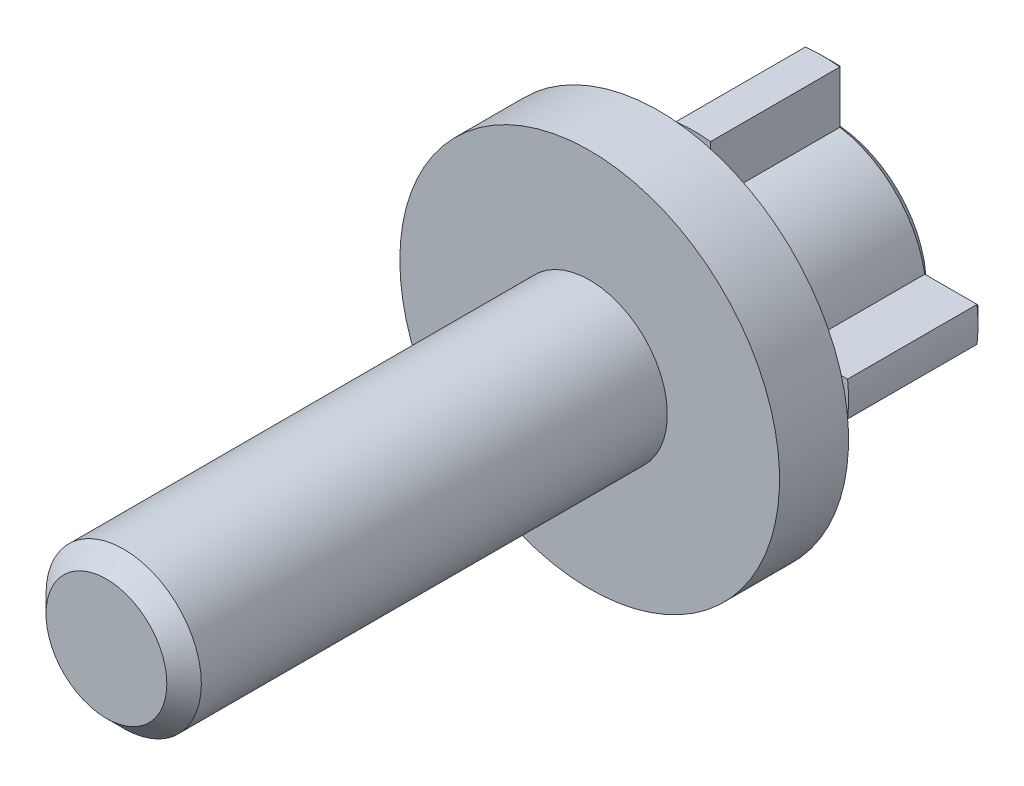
ISO-10303-21;
HEADER;
FILE_DESCRIPTION(('STEP AP214'),'2;1');
FILE_NAME('part.step','',(''),(''),'','','');
FILE_SCHEMA(('AUTOMOTIVE_DESIGN { 1 0 10303 214 1 1 1 1 }'));
ENDSEC;
DATA;
#1=APPLICATION_CONTEXT('core data for automotive mechanical design processes');
#2=APPLICATION_PROTOCOL_DEFINITION('international standard','automotive_design',2000,#1);
#3=PRODUCT_CONTEXT('',#1,'mechanical');
#4=PRODUCT('Part','Part','',(#3));
#5=PRODUCT_RELATED_PRODUCT_CATEGORY('part','',(#4));
#6=PRODUCT_DEFINITION_FORMATION('','',#4);
#7=PRODUCT_DEFINITION_CONTEXT('part definition',#1,'design');
#8=PRODUCT_DEFINITION('design','',#6,#7);
#9=PRODUCT_DEFINITION_SHAPE('','',#8);
#10=(LENGTH_UNIT() NAMED_UNIT(*) SI_UNIT(.MILLI.,.METRE.));
#11=(NAMED_UNIT(*) PLANE_ANGLE_UNIT() SI_UNIT($,.RADIAN.));
#12=(NAMED_UNIT(*) SI_UNIT($,.STERADIAN.) SOLID_ANGLE_UNIT());
#13=UNCERTAINTY_MEASURE_WITH_UNIT(LENGTH_MEASURE(1.E-05),#10,'distance_accuracy_value','');
#14=(GEOMETRIC_REPRESENTATION_CONTEXT(3) GLOBAL_UNCERTAINTY_ASSIGNED_CONTEXT((#13)) GLOBAL_UNIT_ASSIGNED_CONTEXT((#10,
#11,#12)) REPRESENTATION_CONTEXT('',''));
#15=CARTESIAN_POINT('',(0.,0.,0.));
#16=DIRECTION('',(0.,0.,1.));
#17=DIRECTION('',(1.,0.,0.));
#18=AXIS2_PLACEMENT_3D('',#15,#16,#17);
#19=CARTESIAN_POINT('',(0.,0.,-4.));
#20=DIRECTION('',(0.,0.,-1.));
#21=DIRECTION('',(-1.,0.,0.));
#22=AXIS2_PLACEMENT_3D('',#19,#20,#21);
#23=PLANE('',#22);
#24=CARTESIAN_POINT('',(0.,0.,-4.));
#25=DIRECTION('',(0.,0.,-1.));
#26=DIRECTION('',(-1.,0.,0.));
#27=AXIS2_PLACEMENT_3D('',#24,#25,#26);
#28=CIRCLE('',#27,11.);
#29=CARTESIAN_POINT('',(-11.,0.,-4.));
#30=VERTEX_POINT('',#29);
#31=EDGE_CURVE('E425',#30,#30,#28,.T.);
#32=ORIENTED_EDGE('',*,*,#31,.T.);
#33=EDGE_LOOP('',(#32));
#34=FACE_BOUND('',#33,.T.);
#35=CARTESIAN_POINT('',(0.,0.,-4.));
#36=DIRECTION('',(0.,0.,-1.));
#37=DIRECTION('',(-1.,0.,0.));
#38=AXIS2_PLACEMENT_3D('',#35,#36,#37);
#39=CIRCLE('',#38,6.);
#40=CARTESIAN_POINT('',(-6.,0.,-4.));
#41=VERTEX_POINT('',#40);
#42=EDGE_CURVE('E417',#41,#41,#39,.T.);
#43=ORIENTED_EDGE('',*,*,#42,.F.);
#44=EDGE_LOOP('',(#43));
#45=FACE_BOUND('',#44,.T.);
#46=ADVANCED_FACE('F35',(#34,#45),#23,.T.);
#47=CARTESIAN_POINT('',(0.,0.,28.));
#48=DIRECTION('',(0.,0.,-1.));
#49=DIRECTION('',(-1.,0.,0.));
#50=AXIS2_PLACEMENT_3D('',#47,#48,#49);
#51=CYLINDRICAL_SURFACE('',#50,4.5);
#52=CARTESIAN_POINT('',(0.,0.,27.));
#53=DIRECTION('',(0.,0.,1.));
#54=DIRECTION('',(1.,0.,0.));
#55=AXIS2_PLACEMENT_3D('',#52,#53,#54);
#56=CIRCLE('',#55,4.5);
#57=CARTESIAN_POINT('',(4.5,0.,27.));
#58=VERTEX_POINT('',#57);
#59=EDGE_CURVE('E11',#58,#58,#56,.F.);
#60=ORIENTED_EDGE('',*,*,#59,.T.);
#61=EDGE_LOOP('',(#60));
#62=FACE_BOUND('',#61,.T.);
#63=CARTESIAN_POINT('',(0.,0.,0.));
#64=DIRECTION('',(0.,0.,-1.));
#65=DIRECTION('',(-1.,0.,0.));
#66=AXIS2_PLACEMENT_3D('',#63,#64,#65);
#67=CIRCLE('',#66,4.5);
#68=CARTESIAN_POINT('',(-4.5,0.,0.));
#69=VERTEX_POINT('',#68);
#70=EDGE_CURVE('E429',#69,#69,#67,.T.);
#71=ORIENTED_EDGE('',*,*,#70,.F.);
#72=EDGE_LOOP('',(#71));
#73=FACE_BOUND('',#72,.T.);
#74=ADVANCED_FACE('F37',(#62,#73),#51,.T.);
#75=CARTESIAN_POINT('',(0.,0.,28.));
#76=DIRECTION('',(0.,0.,1.));
#77=DIRECTION('',(1.,0.,0.));
#78=AXIS2_PLACEMENT_3D('',#75,#76,#77);
#79=PLANE('',#78);
#80=CARTESIAN_POINT('',(0.,0.,28.));
#81=DIRECTION('',(0.,0.,1.));
#82=DIRECTION('',(1.,0.,0.));
#83=AXIS2_PLACEMENT_3D('',#80,#81,#82);
#84=CIRCLE('',#83,3.5);
#85=CARTESIAN_POINT('',(3.5,0.,28.));
#86=VERTEX_POINT('',#85);
#87=EDGE_CURVE('E44',#86,#86,#84,.T.);
#88=ORIENTED_EDGE('',*,*,#87,.T.);
#89=EDGE_LOOP('',(#88));
#90=FACE_BOUND('',#89,.T.);
#91=ADVANCED_FACE('F696',(#90),#79,.T.);
#92=CARTESIAN_POINT('',(0.,0.,0.));
#93=DIRECTION('',(0.,0.,-1.));
#94=DIRECTION('',(-1.,0.,0.));
#95=AXIS2_PLACEMENT_3D('',#92,#93,#94);
#96=PLANE('',#95);
#97=CARTESIAN_POINT('',(0.,0.,0.));
#98=DIRECTION('',(0.,0.,-1.));
#99=DIRECTION('',(-1.,0.,0.));
#100=AXIS2_PLACEMENT_3D('',#97,#98,#99);
#101=CIRCLE('',#100,11.);
#102=CARTESIAN_POINT('',(-11.,0.,0.));
#103=VERTEX_POINT('',#102);
#104=EDGE_CURVE('E422',#103,#103,#101,.T.);
#105=ORIENTED_EDGE('',*,*,#104,.F.);
#106=EDGE_LOOP('',(#105));
#107=FACE_BOUND('',#106,.T.);
#108=ORIENTED_EDGE('',*,*,#70,.T.);
#109=EDGE_LOOP('',(#108));
#110=FACE_BOUND('',#109,.T.);
#111=ADVANCED_FACE('F701',(#107,#110),#96,.F.);
#112=CARTESIAN_POINT('',(0.,0.,-4.));
#113=DIRECTION('',(0.,0.,1.));
#114=DIRECTION('',(1.,0.,0.));
#115=AXIS2_PLACEMENT_3D('',#112,#113,#114);
#116=CYLINDRICAL_SURFACE('',#115,11.);
#117=ORIENTED_EDGE('',*,*,#31,.F.);
#118=EDGE_LOOP('',(#117));
#119=FACE_BOUND('',#118,.T.);
#120=ORIENTED_EDGE('',*,*,#104,.T.);
#121=EDGE_LOOP('',(#120));
#122=FACE_BOUND('',#121,.T.);
#123=ADVANCED_FACE('F703',(#119,#122),#116,.T.);
#124=CARTESIAN_POINT('',(0.,0.,-6.));
#125=DIRECTION('',(0.,0.,1.));
#126=DIRECTION('',(1.,0.,0.));
#127=AXIS2_PLACEMENT_3D('',#124,#125,#126);
#128=CYLINDRICAL_SURFACE('',#127,6.);
#129=DIRECTION('',(0.,0.,1.));
#130=VECTOR('',#129,1.);
#131=CARTESIAN_POINT('',(-1.00000450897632,5.91607902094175,-14.));
#132=LINE('',#131,#130);
#133=CARTESIAN_POINT('',(-1.00000450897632,5.91607902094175,-13.5));
#134=VERTEX_POINT('',#133);
#135=CARTESIAN_POINT('',(-1.00000450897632,5.91607902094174,-6.));
#136=VERTEX_POINT('',#135);
#137=EDGE_CURVE('E395',#134,#136,#132,.T.);
#138=ORIENTED_EDGE('',*,*,#137,.F.);
#139=CARTESIAN_POINT('',(0.,0.,-13.5));
#140=DIRECTION('',(0.,0.,-1.));
#141=DIRECTION('',(-1.,0.,0.));
#142=AXIS2_PLACEMENT_3D('',#139,#140,#141);
#143=CIRCLE('',#142,6.);
#144=CARTESIAN_POINT('',(-5.91607978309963,0.999999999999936,-13.5));
#145=VERTEX_POINT('',#144);
#146=EDGE_CURVE('E570',#134,#145,#143,.F.);
#147=ORIENTED_EDGE('',*,*,#146,.T.);
#148=DIRECTION('',(0.,0.,1.));
#149=VECTOR('',#148,1.);
#150=CARTESIAN_POINT('',(-5.91607978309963,0.999999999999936,-14.));
#151=LINE('',#150,#149);
#152=CARTESIAN_POINT('',(-5.91607978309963,0.999999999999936,-6.));
#153=VERTEX_POINT('',#152);
#154=EDGE_CURVE('E400',#145,#153,#151,.T.);
#155=ORIENTED_EDGE('',*,*,#154,.T.);
#156=CARTESIAN_POINT('',(0.,0.,-6.));
#157=DIRECTION('',(0.,0.,-1.));
#158=DIRECTION('',(-1.,0.,0.));
#159=AXIS2_PLACEMENT_3D('',#156,#157,#158);
#160=CIRCLE('',#159,6.);
#161=CARTESIAN_POINT('',(-5.91607978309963,-0.999999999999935,-6.));
#162=VERTEX_POINT('',#161);
#163=EDGE_CURVE('E421',#162,#153,#160,.T.);
#164=ORIENTED_EDGE('',*,*,#163,.F.);
#165=DIRECTION('',(0.,0.,1.));
#166=VECTOR('',#165,1.);
#167=CARTESIAN_POINT('',(-5.91607978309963,-0.999999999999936,-14.));
#168=LINE('',#167,#166);
#169=CARTESIAN_POINT('',(-5.91607978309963,-0.999999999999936,-13.5));
#170=VERTEX_POINT('',#169);
#171=EDGE_CURVE('E402',#170,#162,#168,.T.);
#172=ORIENTED_EDGE('',*,*,#171,.F.);
#173=CARTESIAN_POINT('',(0.,0.,-13.5));
#174=DIRECTION('',(0.,0.,-1.));
#175=DIRECTION('',(-1.,0.,0.));
#176=AXIS2_PLACEMENT_3D('',#173,#174,#175);
#177=CIRCLE('',#176,6.);
#178=CARTESIAN_POINT('',(-1.00000450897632,-5.91607902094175,-13.5));
#179=VERTEX_POINT('',#178);
#180=EDGE_CURVE('E574',#170,#179,#177,.F.);
#181=ORIENTED_EDGE('',*,*,#180,.T.);
#182=DIRECTION('',(0.,0.,1.));
#183=VECTOR('',#182,1.);
#184=CARTESIAN_POINT('',(-1.00000450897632,-5.91607902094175,-14.));
#185=LINE('',#184,#183);
#186=CARTESIAN_POINT('',(-1.00000450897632,-5.91607902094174,-6.));
#187=VERTEX_POINT('',#186);
#188=EDGE_CURVE('E406',#179,#187,#185,.T.);
#189=ORIENTED_EDGE('',*,*,#188,.T.);
#190=CARTESIAN_POINT('',(0.999995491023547,-5.91608054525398,-6.));
#191=VERTEX_POINT('',#190);
#192=EDGE_CURVE('E444',#191,#187,#160,.T.);
#193=ORIENTED_EDGE('',*,*,#192,.F.);
#194=DIRECTION('',(0.,0.,1.));
#195=VECTOR('',#194,1.);
#196=CARTESIAN_POINT('',(0.99999549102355,-5.91608054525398,-14.));
#197=LINE('',#196,#195);
#198=CARTESIAN_POINT('',(0.99999549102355,-5.91608054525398,-13.5));
#199=VERTEX_POINT('',#198);
#200=EDGE_CURVE('E408',#199,#191,#197,.T.);
#201=ORIENTED_EDGE('',*,*,#200,.F.);
#202=CARTESIAN_POINT('',(0.,0.,-13.5));
#203=DIRECTION('',(0.,0.,-1.));
#204=DIRECTION('',(-1.,0.,0.));
#205=AXIS2_PLACEMENT_3D('',#202,#203,#204);
#206=CIRCLE('',#205,6.);
#207=CARTESIAN_POINT('',(5.91607978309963,-0.999999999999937,-13.5));
#208=VERTEX_POINT('',#207);
#209=EDGE_CURVE('E612',#199,#208,#206,.F.);
#210=ORIENTED_EDGE('',*,*,#209,.T.);
#211=DIRECTION('',(0.,0.,1.));
#212=VECTOR('',#211,1.);
#213=CARTESIAN_POINT('',(5.91607978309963,-0.999999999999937,-14.));
#214=LINE('',#213,#212);
#215=CARTESIAN_POINT('',(5.91607978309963,-0.999999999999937,-6.));
#216=VERTEX_POINT('',#215);
#217=EDGE_CURVE('E412',#208,#216,#214,.T.);
#218=ORIENTED_EDGE('',*,*,#217,.T.);
#219=CARTESIAN_POINT('',(5.91607978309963,0.999999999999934,-6.));
#220=VERTEX_POINT('',#219);
#221=EDGE_CURVE('E442',#220,#216,#160,.T.);
#222=ORIENTED_EDGE('',*,*,#221,.F.);
#223=DIRECTION('',(0.,0.,1.));
#224=VECTOR('',#223,1.);
#225=CARTESIAN_POINT('',(5.91607978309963,0.999999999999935,-14.));
#226=LINE('',#225,#224);
#227=CARTESIAN_POINT('',(5.91607978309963,0.999999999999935,-13.5));
#228=VERTEX_POINT('',#227);
#229=EDGE_CURVE('E414',#228,#220,#226,.T.);
#230=ORIENTED_EDGE('',*,*,#229,.F.);
#231=CARTESIAN_POINT('',(0.,0.,-13.5));
#232=DIRECTION('',(0.,0.,-1.));
#233=DIRECTION('',(-1.,0.,0.));
#234=AXIS2_PLACEMENT_3D('',#231,#232,#233);
#235=CIRCLE('',#234,6.);
#236=CARTESIAN_POINT('',(0.999995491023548,5.91608054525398,-13.5));
#237=VERTEX_POINT('',#236);
#238=EDGE_CURVE('E508',#228,#237,#235,.F.);
#239=ORIENTED_EDGE('',*,*,#238,.T.);
#240=DIRECTION('',(0.,0.,1.));
#241=VECTOR('',#240,1.);
#242=CARTESIAN_POINT('',(0.999995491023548,5.91608054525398,-14.));
#243=LINE('',#242,#241);
#244=CARTESIAN_POINT('',(0.999995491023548,5.91608054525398,-6.));
#245=VERTEX_POINT('',#244);
#246=EDGE_CURVE('E418',#237,#245,#243,.T.);
#247=ORIENTED_EDGE('',*,*,#246,.T.);
#248=EDGE_CURVE('E426',#136,#245,#160,.T.);
#249=ORIENTED_EDGE('',*,*,#248,.F.);
#250=EDGE_LOOP('',(#138,#147,#155,#164,#172,#181,#189,#193,#201,#210,#218,#222,#230,#239,#247,#249));
#251=FACE_BOUND('',#250,.T.);
#252=ORIENTED_EDGE('',*,*,#42,.T.);
#253=EDGE_LOOP('',(#252));
#254=FACE_BOUND('',#253,.T.);
#255=ADVANCED_FACE('F580',(#251,#254),#128,.T.);
#256=CARTESIAN_POINT('',(0.,0.,-6.));
#257=DIRECTION('',(0.,0.,-1.));
#258=DIRECTION('',(-1.,0.,0.));
#259=AXIS2_PLACEMENT_3D('',#256,#257,#258);
#260=PLANE('',#259);
#261=DIRECTION('',(0.,1.,0.));
#262=VECTOR('',#261,1.);
#263=CARTESIAN_POINT('',(-1.00000450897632,5.91607902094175,-6.));
#264=LINE('',#263,#262);
#265=CARTESIAN_POINT('',(-1.00000450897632,8.94427140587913,-6.));
#266=VERTEX_POINT('',#265);
#267=EDGE_CURVE('E396',#136,#266,#264,.T.);
#268=ORIENTED_EDGE('',*,*,#267,.F.);
#269=ORIENTED_EDGE('',*,*,#248,.T.);
#270=DIRECTION('',(0.,-1.,0.));
#271=VECTOR('',#270,1.);
#272=CARTESIAN_POINT('',(0.999995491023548,5.91608054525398,-6.));
#273=LINE('',#272,#271);
#274=CARTESIAN_POINT('',(0.999995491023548,8.9442724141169,-6.));
#275=VERTEX_POINT('',#274);
#276=EDGE_CURVE('E377',#275,#245,#273,.T.);
#277=ORIENTED_EDGE('',*,*,#276,.F.);
#278=CARTESIAN_POINT('',(0.,0.,-6.));
#279=DIRECTION('',(0.,0.,-1.));
#280=DIRECTION('',(-1.,0.,0.));
#281=AXIS2_PLACEMENT_3D('',#278,#279,#280);
#282=CIRCLE('',#281,9.);
#283=EDGE_CURVE('E374',#266,#275,#282,.T.);
#284=ORIENTED_EDGE('',*,*,#283,.F.);
#285=EDGE_LOOP('',(#268,#269,#277,#284));
#286=FACE_BOUND('',#285,.T.);
#287=ADVANCED_FACE('F588',(#286),#260,.F.);
#288=DIRECTION('',(1.,0.,0.));
#289=VECTOR('',#288,1.);
#290=CARTESIAN_POINT('',(5.91607978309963,0.999999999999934,-6.));
#291=LINE('',#290,#289);
#292=CARTESIAN_POINT('',(8.94427190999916,0.999999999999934,-6.));
#293=VERTEX_POINT('',#292);
#294=EDGE_CURVE('E382',#220,#293,#291,.T.);
#295=ORIENTED_EDGE('',*,*,#294,.F.);
#296=ORIENTED_EDGE('',*,*,#221,.T.);
#297=DIRECTION('',(-1.,0.,0.));
#298=VECTOR('',#297,1.);
#299=CARTESIAN_POINT('',(5.91607978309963,-0.999999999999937,-6.));
#300=LINE('',#299,#298);
#301=CARTESIAN_POINT('',(8.94427190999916,-0.999999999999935,-6.));
#302=VERTEX_POINT('',#301);
#303=EDGE_CURVE('E381',#302,#216,#300,.T.);
#304=ORIENTED_EDGE('',*,*,#303,.F.);
#305=CARTESIAN_POINT('',(0.,0.,-6.));
#306=DIRECTION('',(0.,0.,-1.));
#307=DIRECTION('',(-1.,0.,0.));
#308=AXIS2_PLACEMENT_3D('',#305,#306,#307);
#309=CIRCLE('',#308,9.);
#310=EDGE_CURVE('E378',#293,#302,#309,.T.);
#311=ORIENTED_EDGE('',*,*,#310,.F.);
#312=EDGE_LOOP('',(#295,#296,#304,#311));
#313=FACE_BOUND('',#312,.T.);
#314=ADVANCED_FACE('F939',(#313),#260,.F.);
#315=DIRECTION('',(0.,-1.,0.));
#316=VECTOR('',#315,1.);
#317=CARTESIAN_POINT('',(0.999995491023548,-5.91608054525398,-6.));
#318=LINE('',#317,#316);
#319=CARTESIAN_POINT('',(0.99999549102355,-8.9442724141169,-6.));
#320=VERTEX_POINT('',#319);
#321=EDGE_CURVE('E387',#191,#320,#318,.T.);
#322=ORIENTED_EDGE('',*,*,#321,.F.);
#323=ORIENTED_EDGE('',*,*,#192,.T.);
#324=DIRECTION('',(0.,1.,0.));
#325=VECTOR('',#324,1.);
#326=CARTESIAN_POINT('',(-1.00000450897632,-5.91607902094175,-6.));
#327=LINE('',#326,#325);
#328=CARTESIAN_POINT('',(-1.00000450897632,-8.94427140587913,-6.));
#329=VERTEX_POINT('',#328);
#330=EDGE_CURVE('E386',#329,#187,#327,.T.);
#331=ORIENTED_EDGE('',*,*,#330,.F.);
#332=CARTESIAN_POINT('',(0.,0.,-6.));
#333=DIRECTION('',(0.,0.,-1.));
#334=DIRECTION('',(-1.,0.,0.));
#335=AXIS2_PLACEMENT_3D('',#332,#333,#334);
#336=CIRCLE('',#335,9.);
#337=EDGE_CURVE('E383',#320,#329,#336,.T.);
#338=ORIENTED_EDGE('',*,*,#337,.F.);
#339=EDGE_LOOP('',(#322,#323,#331,#338));
#340=FACE_BOUND('',#339,.T.);
#341=ADVANCED_FACE('F673',(#340),#260,.F.);
#342=DIRECTION('',(-1.,0.,0.));
#343=VECTOR('',#342,1.);
#344=CARTESIAN_POINT('',(-5.91607978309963,-0.999999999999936,-6.));
#345=LINE('',#344,#343);
#346=CARTESIAN_POINT('',(-8.94427190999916,-0.999999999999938,-6.));
#347=VERTEX_POINT('',#346);
#348=EDGE_CURVE('E392',#162,#347,#345,.T.);
#349=ORIENTED_EDGE('',*,*,#348,.F.);
#350=ORIENTED_EDGE('',*,*,#163,.T.);
#351=DIRECTION('',(1.,0.,0.));
#352=VECTOR('',#351,1.);
#353=CARTESIAN_POINT('',(-5.91607978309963,0.999999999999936,-6.));
#354=LINE('',#353,#352);
#355=CARTESIAN_POINT('',(-8.94427190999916,0.999999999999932,-6.));
#356=VERTEX_POINT('',#355);
#357=EDGE_CURVE('E391',#356,#153,#354,.T.);
#358=ORIENTED_EDGE('',*,*,#357,.F.);
#359=CARTESIAN_POINT('',(0.,0.,-6.));
#360=DIRECTION('',(0.,0.,-1.));
#361=DIRECTION('',(-1.,0.,0.));
#362=AXIS2_PLACEMENT_3D('',#359,#360,#361);
#363=CIRCLE('',#362,9.);
#364=EDGE_CURVE('E388',#347,#356,#363,.T.);
#365=ORIENTED_EDGE('',*,*,#364,.F.);
#366=EDGE_LOOP('',(#349,#350,#358,#365));
#367=FACE_BOUND('',#366,.T.);
#368=ADVANCED_FACE('F457',(#367),#260,.F.);
#369=CARTESIAN_POINT('',(0.,0.,-14.));
#370=DIRECTION('',(0.,0.,1.));
#371=DIRECTION('',(1.,0.,0.));
#372=AXIS2_PLACEMENT_3D('',#369,#370,#371);
#373=CYLINDRICAL_SURFACE('',#372,9.);
#374=DIRECTION('',(0.,0.,1.));
#375=VECTOR('',#374,1.);
#376=CARTESIAN_POINT('',(0.999995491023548,8.9442724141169,-14.));
#377=LINE('',#376,#375);
#378=CARTESIAN_POINT('',(0.999995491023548,8.9442724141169,-13.5));
#379=VERTEX_POINT('',#378);
#380=EDGE_CURVE('E415',#379,#275,#377,.T.);
#381=ORIENTED_EDGE('',*,*,#380,.F.);
#382=CARTESIAN_POINT('',(0.,0.,-13.5));
#383=DIRECTION('',(0.,0.,-1.));
#384=DIRECTION('',(-1.,0.,0.));
#385=AXIS2_PLACEMENT_3D('',#382,#383,#384);
#386=CIRCLE('',#385,9.);
#387=CARTESIAN_POINT('',(-1.00000450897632,8.94427140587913,-13.5));
#388=VERTEX_POINT('',#387);
#389=EDGE_CURVE('E564',#379,#388,#386,.F.);
#390=ORIENTED_EDGE('',*,*,#389,.T.);
#391=DIRECTION('',(0.,0.,1.));
#392=VECTOR('',#391,1.);
#393=CARTESIAN_POINT('',(-1.00000450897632,8.94427140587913,-14.));
#394=LINE('',#393,#392);
#395=EDGE_CURVE('E393',#388,#266,#394,.T.);
#396=ORIENTED_EDGE('',*,*,#395,.T.);
#397=ORIENTED_EDGE('',*,*,#283,.T.);
#398=EDGE_LOOP('',(#381,#390,#396,#397));
#399=FACE_BOUND('',#398,.T.);
#400=ADVANCED_FACE('F590',(#399),#373,.T.);
#401=CARTESIAN_POINT('',(0.999995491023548,5.91608054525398,-14.));
#402=DIRECTION('',(-1.,0.,0.));
#403=DIRECTION('',(0.,0.,1.));
#404=AXIS2_PLACEMENT_3D('',#401,#402,#403);
#405=PLANE('',#404);
#406=ORIENTED_EDGE('',*,*,#246,.F.);
#407=DIRECTION('',(0.,1.,0.));
#408=VECTOR('',#407,1.);
#409=CARTESIAN_POINT('',(0.999995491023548,8.9442724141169,-13.5));
#410=LINE('',#409,#408);
#411=EDGE_CURVE('E51',#237,#379,#410,.T.);
#412=ORIENTED_EDGE('',*,*,#411,.T.);
#413=ORIENTED_EDGE('',*,*,#380,.T.);
#414=ORIENTED_EDGE('',*,*,#276,.T.);
#415=EDGE_LOOP('',(#406,#412,#413,#414));
#416=FACE_BOUND('',#415,.T.);
#417=ADVANCED_FACE('F622',(#416),#405,.F.);
#418=CARTESIAN_POINT('',(5.91607978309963,0.999999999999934,-14.));
#419=DIRECTION('',(0.,-1.,0.));
#420=DIRECTION('',(1.,0.,0.));
#421=AXIS2_PLACEMENT_3D('',#418,#419,#420);
#422=PLANE('',#421);
#423=DIRECTION('',(0.,0.,1.));
#424=VECTOR('',#423,1.);
#425=CARTESIAN_POINT('',(8.94427190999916,0.999999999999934,-14.));
#426=LINE('',#425,#424);
#427=CARTESIAN_POINT('',(8.94427190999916,0.999999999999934,-13.5));
#428=VERTEX_POINT('',#427);
#429=EDGE_CURVE('E411',#428,#293,#426,.T.);
#430=ORIENTED_EDGE('',*,*,#429,.F.);
#431=DIRECTION('',(-1.,0.,0.));
#432=VECTOR('',#431,1.);
#433=CARTESIAN_POINT('',(5.91607978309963,0.999999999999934,-13.5));
#434=LINE('',#433,#432);
#435=EDGE_CURVE('E594',#428,#228,#434,.T.);
#436=ORIENTED_EDGE('',*,*,#435,.T.);
#437=ORIENTED_EDGE('',*,*,#229,.T.);
#438=ORIENTED_EDGE('',*,*,#294,.T.);
#439=EDGE_LOOP('',(#430,#436,#437,#438));
#440=FACE_BOUND('',#439,.T.);
#441=ADVANCED_FACE('F970',(#440),#422,.F.);
#442=CARTESIAN_POINT('',(0.,0.,-14.));
#443=DIRECTION('',(0.,0.,1.));
#444=DIRECTION('',(1.,0.,0.));
#445=AXIS2_PLACEMENT_3D('',#442,#443,#444);
#446=CYLINDRICAL_SURFACE('',#445,9.);
#447=DIRECTION('',(0.,0.,1.));
#448=VECTOR('',#447,1.);
#449=CARTESIAN_POINT('',(8.94427190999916,-0.999999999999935,-14.));
#450=LINE('',#449,#448);
#451=CARTESIAN_POINT('',(8.94427190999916,-0.999999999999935,-13.5));
#452=VERTEX_POINT('',#451);
#453=EDGE_CURVE('E409',#452,#302,#450,.T.);
#454=ORIENTED_EDGE('',*,*,#453,.F.);
#455=CARTESIAN_POINT('',(0.,0.,-13.5));
#456=DIRECTION('',(0.,0.,-1.));
#457=DIRECTION('',(-1.,0.,0.));
#458=AXIS2_PLACEMENT_3D('',#455,#456,#457);
#459=CIRCLE('',#458,9.);
#460=EDGE_CURVE('E59',#452,#428,#459,.F.);
#461=ORIENTED_EDGE('',*,*,#460,.T.);
#462=ORIENTED_EDGE('',*,*,#429,.T.);
#463=ORIENTED_EDGE('',*,*,#310,.T.);
#464=EDGE_LOOP('',(#454,#461,#462,#463));
#465=FACE_BOUND('',#464,.T.);
#466=ADVANCED_FACE('F687',(#465),#446,.T.);
#467=CARTESIAN_POINT('',(5.91607978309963,-0.999999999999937,-14.));
#468=DIRECTION('',(0.,1.,0.));
#469=DIRECTION('',(-1.,0.,0.));
#470=AXIS2_PLACEMENT_3D('',#467,#468,#469);
#471=PLANE('',#470);
#472=ORIENTED_EDGE('',*,*,#217,.F.);
#473=DIRECTION('',(1.,0.,0.));
#474=VECTOR('',#473,1.);
#475=CARTESIAN_POINT('',(8.94427190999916,-0.999999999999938,-13.5));
#476=LINE('',#475,#474);
#477=EDGE_CURVE('E599',#208,#452,#476,.T.);
#478=ORIENTED_EDGE('',*,*,#477,.T.);
#479=ORIENTED_EDGE('',*,*,#453,.T.);
#480=ORIENTED_EDGE('',*,*,#303,.T.);
#481=EDGE_LOOP('',(#472,#478,#479,#480));
#482=FACE_BOUND('',#481,.T.);
#483=ADVANCED_FACE('F680',(#482),#471,.F.);
#484=CARTESIAN_POINT('',(0.999995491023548,-5.91608054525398,-14.));
#485=DIRECTION('',(-1.,0.,0.));
#486=DIRECTION('',(0.,-1.,0.));
#487=AXIS2_PLACEMENT_3D('',#484,#485,#486);
#488=PLANE('',#487);
#489=DIRECTION('',(0.,0.,1.));
#490=VECTOR('',#489,1.);
#491=CARTESIAN_POINT('',(0.99999549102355,-8.9442724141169,-14.));
#492=LINE('',#491,#490);
#493=CARTESIAN_POINT('',(0.99999549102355,-8.9442724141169,-13.5));
#494=VERTEX_POINT('',#493);
#495=EDGE_CURVE('E405',#494,#320,#492,.T.);
#496=ORIENTED_EDGE('',*,*,#495,.F.);
#497=DIRECTION('',(0.,1.,0.));
#498=VECTOR('',#497,1.);
#499=CARTESIAN_POINT('',(0.999995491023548,-5.91608054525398,-13.5));
#500=LINE('',#499,#498);
#501=EDGE_CURVE('E601',#494,#199,#500,.T.);
#502=ORIENTED_EDGE('',*,*,#501,.T.);
#503=ORIENTED_EDGE('',*,*,#200,.T.);
#504=ORIENTED_EDGE('',*,*,#321,.T.);
#505=EDGE_LOOP('',(#496,#502,#503,#504));
#506=FACE_BOUND('',#505,.T.);
#507=ADVANCED_FACE('F678',(#506),#488,.F.);
#508=CARTESIAN_POINT('',(0.,0.,-14.));
#509=DIRECTION('',(0.,0.,1.));
#510=DIRECTION('',(1.,0.,0.));
#511=AXIS2_PLACEMENT_3D('',#508,#509,#510);
#512=CYLINDRICAL_SURFACE('',#511,9.);
#513=DIRECTION('',(0.,0.,1.));
#514=VECTOR('',#513,1.);
#515=CARTESIAN_POINT('',(-1.00000450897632,-8.94427140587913,-14.));
#516=LINE('',#515,#514);
#517=CARTESIAN_POINT('',(-1.00000450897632,-8.94427140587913,-13.5));
#518=VERTEX_POINT('',#517);
#519=EDGE_CURVE('E403',#518,#329,#516,.T.);
#520=ORIENTED_EDGE('',*,*,#519,.F.);
#521=CARTESIAN_POINT('',(0.,0.,-13.5));
#522=DIRECTION('',(0.,0.,-1.));
#523=DIRECTION('',(-1.,0.,0.));
#524=AXIS2_PLACEMENT_3D('',#521,#522,#523);
#525=CIRCLE('',#524,9.);
#526=EDGE_CURVE('E603',#518,#494,#525,.F.);
#527=ORIENTED_EDGE('',*,*,#526,.T.);
#528=ORIENTED_EDGE('',*,*,#495,.T.);
#529=ORIENTED_EDGE('',*,*,#337,.T.);
#530=EDGE_LOOP('',(#520,#527,#528,#529));
#531=FACE_BOUND('',#530,.T.);
#532=ADVANCED_FACE('F675',(#531),#512,.T.);
#533=CARTESIAN_POINT('',(-1.00000450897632,-5.91607902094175,-14.));
#534=DIRECTION('',(1.,0.,0.));
#535=DIRECTION('',(0.,1.,0.));
#536=AXIS2_PLACEMENT_3D('',#533,#534,#535);
#537=PLANE('',#536);
#538=ORIENTED_EDGE('',*,*,#188,.F.);
#539=DIRECTION('',(0.,-1.,0.));
#540=VECTOR('',#539,1.);
#541=CARTESIAN_POINT('',(-1.00000450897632,-8.94427140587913,-13.5));
#542=LINE('',#541,#540);
#543=EDGE_CURVE('E605',#179,#518,#542,.T.);
#544=ORIENTED_EDGE('',*,*,#543,.T.);
#545=ORIENTED_EDGE('',*,*,#519,.T.);
#546=ORIENTED_EDGE('',*,*,#330,.T.);
#547=EDGE_LOOP('',(#538,#544,#545,#546));
#548=FACE_BOUND('',#547,.T.);
#549=ADVANCED_FACE('F670',(#548),#537,.F.);
#550=CARTESIAN_POINT('',(-5.91607978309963,-0.999999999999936,-14.));
#551=DIRECTION('',(0.,1.,0.));
#552=DIRECTION('',(-1.,0.,0.));
#553=AXIS2_PLACEMENT_3D('',#550,#551,#552);
#554=PLANE('',#553);
#555=DIRECTION('',(0.,0.,1.));
#556=VECTOR('',#555,1.);
#557=CARTESIAN_POINT('',(-8.94427190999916,-0.999999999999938,-14.));
#558=LINE('',#557,#556);
#559=CARTESIAN_POINT('',(-8.94427190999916,-0.999999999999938,-13.5));
#560=VERTEX_POINT('',#559);
#561=EDGE_CURVE('E399',#560,#347,#558,.T.);
#562=ORIENTED_EDGE('',*,*,#561,.F.);
#563=DIRECTION('',(1.,0.,0.));
#564=VECTOR('',#563,1.);
#565=CARTESIAN_POINT('',(-5.91607978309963,-0.999999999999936,-13.5));
#566=LINE('',#565,#564);
#567=EDGE_CURVE('E607',#560,#170,#566,.T.);
#568=ORIENTED_EDGE('',*,*,#567,.T.);
#569=ORIENTED_EDGE('',*,*,#171,.T.);
#570=ORIENTED_EDGE('',*,*,#348,.T.);
#571=EDGE_LOOP('',(#562,#568,#569,#570));
#572=FACE_BOUND('',#571,.T.);
#573=ADVANCED_FACE('F665',(#572),#554,.F.);
#574=CARTESIAN_POINT('',(0.,0.,-14.));
#575=DIRECTION('',(0.,0.,1.));
#576=DIRECTION('',(1.,0.,0.));
#577=AXIS2_PLACEMENT_3D('',#574,#575,#576);
#578=CYLINDRICAL_SURFACE('',#577,9.);
#579=DIRECTION('',(0.,0.,1.));
#580=VECTOR('',#579,1.);
#581=CARTESIAN_POINT('',(-8.94427190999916,0.999999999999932,-14.));
#582=LINE('',#581,#580);
#583=CARTESIAN_POINT('',(-8.94427190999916,0.999999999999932,-13.5));
#584=VERTEX_POINT('',#583);
#585=EDGE_CURVE('E397',#584,#356,#582,.T.);
#586=ORIENTED_EDGE('',*,*,#585,.F.);
#587=CARTESIAN_POINT('',(0.,0.,-13.5));
#588=DIRECTION('',(0.,0.,-1.));
#589=DIRECTION('',(-1.,0.,0.));
#590=AXIS2_PLACEMENT_3D('',#587,#588,#589);
#591=CIRCLE('',#590,9.);
#592=EDGE_CURVE('E609',#584,#560,#591,.F.);
#593=ORIENTED_EDGE('',*,*,#592,.T.);
#594=ORIENTED_EDGE('',*,*,#561,.T.);
#595=ORIENTED_EDGE('',*,*,#364,.T.);
#596=EDGE_LOOP('',(#586,#593,#594,#595));
#597=FACE_BOUND('',#596,.T.);
#598=ADVANCED_FACE('F662',(#597),#578,.T.);
#599=CARTESIAN_POINT('',(-5.91607978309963,0.999999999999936,-14.));
#600=DIRECTION('',(0.,-1.,0.));
#601=DIRECTION('',(1.,0.,0.));
#602=AXIS2_PLACEMENT_3D('',#599,#600,#601);
#603=PLANE('',#602);
#604=ORIENTED_EDGE('',*,*,#154,.F.);
#605=DIRECTION('',(-1.,0.,0.));
#606=VECTOR('',#605,1.);
#607=CARTESIAN_POINT('',(-8.94427190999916,0.999999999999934,-13.5));
#608=LINE('',#607,#606);
#609=EDGE_CURVE('E573',#145,#584,#608,.T.);
#610=ORIENTED_EDGE('',*,*,#609,.T.);
#611=ORIENTED_EDGE('',*,*,#585,.T.);
#612=ORIENTED_EDGE('',*,*,#357,.T.);
#613=EDGE_LOOP('',(#604,#610,#611,#612));
#614=FACE_BOUND('',#613,.T.);
#615=ADVANCED_FACE('F464',(#614),#603,.F.);
#616=CARTESIAN_POINT('',(-1.00000450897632,5.91607902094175,-14.));
#617=DIRECTION('',(1.,0.,0.));
#618=DIRECTION('',(0.,1.,0.));
#619=AXIS2_PLACEMENT_3D('',#616,#617,#618);
#620=PLANE('',#619);
#621=ORIENTED_EDGE('',*,*,#395,.F.);
#622=DIRECTION('',(0.,-1.,0.));
#623=VECTOR('',#622,1.);
#624=CARTESIAN_POINT('',(-1.00000450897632,5.91607902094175,-13.5));
#625=LINE('',#624,#623);
#626=EDGE_CURVE('E479',#388,#134,#625,.T.);
#627=ORIENTED_EDGE('',*,*,#626,.T.);
#628=ORIENTED_EDGE('',*,*,#137,.T.);
#629=ORIENTED_EDGE('',*,*,#267,.T.);
#630=EDGE_LOOP('',(#621,#627,#628,#629));
#631=FACE_BOUND('',#630,.T.);
#632=ADVANCED_FACE('F578',(#631),#620,.F.);
#633=CARTESIAN_POINT('',(0.,0.,-14.));
#634=DIRECTION('',(0.,0.,-1.));
#635=DIRECTION('',(-1.,0.,0.));
#636=AXIS2_PLACEMENT_3D('',#633,#634,#635);
#637=PLANE('',#636);
#638=CARTESIAN_POINT('',(0.,0.,-14.));
#639=DIRECTION('',(0.,0.,-1.));
#640=DIRECTION('',(-1.,0.,0.));
#641=AXIS2_PLACEMENT_3D('',#638,#639,#640);
#642=CIRCLE('',#641,4.);
#643=CARTESIAN_POINT('',(-4.,0.,-14.));
#644=VERTEX_POINT('',#643);
#645=EDGE_CURVE('E39',#644,#644,#642,.T.);
#646=ORIENTED_EDGE('',*,*,#645,.F.);
#647=EDGE_LOOP('',(#646));
#648=FACE_BOUND('',#647,.T.);
#649=CARTESIAN_POINT('',(0.,0.,-14.));
#650=DIRECTION('',(0.,0.,-1.));
#651=DIRECTION('',(-1.,0.,0.));
#652=AXIS2_PLACEMENT_3D('',#649,#650,#651);
#653=CIRCLE('',#652,5.5);
#654=CARTESIAN_POINT('',(-5.47722557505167,0.499999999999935,-14.));
#655=VERTEX_POINT('',#654);
#656=CARTESIAN_POINT('',(-0.500004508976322,5.47722516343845,-14.));
#657=VERTEX_POINT('',#656);
#658=EDGE_CURVE('E521',#655,#657,#653,.T.);
#659=ORIENTED_EDGE('',*,*,#658,.T.);
#660=DIRECTION('',(0.,1.,0.));
#661=VECTOR('',#660,1.);
#662=CARTESIAN_POINT('',(-0.500004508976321,8.94427140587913,-14.));
#663=LINE('',#662,#661);
#664=CARTESIAN_POINT('',(-0.500004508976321,8.48528110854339,-14.));
#665=VERTEX_POINT('',#664);
#666=EDGE_CURVE('E518',#657,#665,#663,.T.);
#667=ORIENTED_EDGE('',*,*,#666,.T.);
#668=CARTESIAN_POINT('',(0.,0.,-14.));
#669=DIRECTION('',(0.,0.,-1.));
#670=DIRECTION('',(-1.,0.,0.));
#671=AXIS2_PLACEMENT_3D('',#668,#669,#670);
#672=CIRCLE('',#671,8.5);
#673=CARTESIAN_POINT('',(0.499995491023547,8.48528163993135,-14.));
#674=VERTEX_POINT('',#673);
#675=EDGE_CURVE('E432',#665,#674,#672,.T.);
#676=ORIENTED_EDGE('',*,*,#675,.T.);
#677=DIRECTION('',(0.,-1.,0.));
#678=VECTOR('',#677,1.);
#679=CARTESIAN_POINT('',(0.499995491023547,5.91608054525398,-14.));
#680=LINE('',#679,#678);
#681=CARTESIAN_POINT('',(0.499995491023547,5.47722598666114,-14.));
#682=VERTEX_POINT('',#681);
#683=EDGE_CURVE('E547',#674,#682,#680,.T.);
#684=ORIENTED_EDGE('',*,*,#683,.T.);
#685=CARTESIAN_POINT('',(0.,0.,-14.));
#686=DIRECTION('',(0.,0.,-1.));
#687=DIRECTION('',(-1.,0.,0.));
#688=AXIS2_PLACEMENT_3D('',#685,#686,#687);
#689=CIRCLE('',#688,5.5);
#690=CARTESIAN_POINT('',(5.47722557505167,0.499999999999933,-14.));
#691=VERTEX_POINT('',#690);
#692=EDGE_CURVE('E545',#682,#691,#689,.T.);
#693=ORIENTED_EDGE('',*,*,#692,.T.);
#694=DIRECTION('',(1.,0.,0.));
#695=VECTOR('',#694,1.);
#696=CARTESIAN_POINT('',(8.94427190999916,0.499999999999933,-14.));
#697=LINE('',#696,#695);
#698=CARTESIAN_POINT('',(8.48528137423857,0.499999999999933,-14.));
#699=VERTEX_POINT('',#698);
#700=EDGE_CURVE('E543',#691,#699,#697,.T.);
#701=ORIENTED_EDGE('',*,*,#700,.T.);
#702=CARTESIAN_POINT('',(0.,0.,-14.));
#703=DIRECTION('',(0.,0.,-1.));
#704=DIRECTION('',(-1.,0.,0.));
#705=AXIS2_PLACEMENT_3D('',#702,#703,#704);
#706=CIRCLE('',#705,8.49999999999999);
#707=CARTESIAN_POINT('',(8.48528137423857,-0.499999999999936,-14.));
#708=VERTEX_POINT('',#707);
#709=EDGE_CURVE('E541',#699,#708,#706,.T.);
#710=ORIENTED_EDGE('',*,*,#709,.T.);
#711=DIRECTION('',(-1.,0.,0.));
#712=VECTOR('',#711,1.);
#713=CARTESIAN_POINT('',(5.91607978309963,-0.499999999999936,-14.));
#714=LINE('',#713,#712);
#715=CARTESIAN_POINT('',(5.47722557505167,-0.499999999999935,-14.));
#716=VERTEX_POINT('',#715);
#717=EDGE_CURVE('E539',#708,#716,#714,.T.);
#718=ORIENTED_EDGE('',*,*,#717,.T.);
#719=CARTESIAN_POINT('',(0.,0.,-14.));
#720=DIRECTION('',(0.,0.,-1.));
#721=DIRECTION('',(-1.,0.,0.));
#722=AXIS2_PLACEMENT_3D('',#719,#720,#721);
#723=CIRCLE('',#722,5.5);
#724=CARTESIAN_POINT('',(0.499995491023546,-5.47722598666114,-14.));
#725=VERTEX_POINT('',#724);
#726=EDGE_CURVE('E537',#716,#725,#723,.T.);
#727=ORIENTED_EDGE('',*,*,#726,.T.);
#728=DIRECTION('',(0.,-1.,0.));
#729=VECTOR('',#728,1.);
#730=CARTESIAN_POINT('',(0.499995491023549,-8.9442724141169,-14.));
#731=LINE('',#730,#729);
#732=CARTESIAN_POINT('',(0.499995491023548,-8.48528163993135,-14.));
#733=VERTEX_POINT('',#732);
#734=EDGE_CURVE('E535',#725,#733,#731,.T.);
#735=ORIENTED_EDGE('',*,*,#734,.T.);
#736=CARTESIAN_POINT('',(0.,0.,-14.));
#737=DIRECTION('',(0.,0.,-1.));
#738=DIRECTION('',(-1.,0.,0.));
#739=AXIS2_PLACEMENT_3D('',#736,#737,#738);
#740=CIRCLE('',#739,8.5);
#741=CARTESIAN_POINT('',(-0.500004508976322,-8.48528110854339,-14.));
#742=VERTEX_POINT('',#741);
#743=EDGE_CURVE('E533',#733,#742,#740,.T.);
#744=ORIENTED_EDGE('',*,*,#743,.T.);
#745=DIRECTION('',(0.,1.,0.));
#746=VECTOR('',#745,1.);
#747=CARTESIAN_POINT('',(-0.500004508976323,-5.91607902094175,-14.));
#748=LINE('',#747,#746);
#749=CARTESIAN_POINT('',(-0.500004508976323,-5.47722516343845,-14.));
#750=VERTEX_POINT('',#749);
#751=EDGE_CURVE('E531',#742,#750,#748,.T.);
#752=ORIENTED_EDGE('',*,*,#751,.T.);
#753=CARTESIAN_POINT('',(0.,0.,-14.));
#754=DIRECTION('',(0.,0.,-1.));
#755=DIRECTION('',(-1.,0.,0.));
#756=AXIS2_PLACEMENT_3D('',#753,#754,#755);
#757=CIRCLE('',#756,5.5);
#758=CARTESIAN_POINT('',(-5.47722557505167,-0.499999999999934,-14.));
#759=VERTEX_POINT('',#758);
#760=EDGE_CURVE('E529',#750,#759,#757,.T.);
#761=ORIENTED_EDGE('',*,*,#760,.T.);
#762=DIRECTION('',(-1.,0.,0.));
#763=VECTOR('',#762,1.);
#764=CARTESIAN_POINT('',(-8.94427190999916,-0.499999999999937,-14.));
#765=LINE('',#764,#763);
#766=CARTESIAN_POINT('',(-8.48528137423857,-0.499999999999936,-14.));
#767=VERTEX_POINT('',#766);
#768=EDGE_CURVE('E527',#759,#767,#765,.T.);
#769=ORIENTED_EDGE('',*,*,#768,.T.);
#770=CARTESIAN_POINT('',(0.,0.,-14.));
#771=DIRECTION('',(0.,0.,-1.));
#772=DIRECTION('',(-1.,0.,0.));
#773=AXIS2_PLACEMENT_3D('',#770,#771,#772);
#774=CIRCLE('',#773,8.49999999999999);
#775=CARTESIAN_POINT('',(-8.48528137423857,0.499999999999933,-14.));
#776=VERTEX_POINT('',#775);
#777=EDGE_CURVE('E525',#767,#776,#774,.T.);
#778=ORIENTED_EDGE('',*,*,#777,.T.);
#779=DIRECTION('',(1.,0.,0.));
#780=VECTOR('',#779,1.);
#781=CARTESIAN_POINT('',(-5.91607978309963,0.499999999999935,-14.));
#782=LINE('',#781,#780);
#783=EDGE_CURVE('E523',#776,#655,#782,.T.);
#784=ORIENTED_EDGE('',*,*,#783,.T.);
#785=EDGE_LOOP('',(#659,#667,#676,#684,#693,#701,#710,#718,#727,#735,#744,#752,#761,#769,#778,#784));
#786=FACE_BOUND('',#785,.T.);
#787=ADVANCED_FACE('F553',(#648,#786),#637,.T.);
#788=CARTESIAN_POINT('',(0.499995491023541,0.,-14.));
#789=DIRECTION('',(0.707106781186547,0.,-0.707106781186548));
#790=DIRECTION('',(-0.707106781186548,0.,-0.707106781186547));
#791=AXIS2_PLACEMENT_3D('',#788,#789,#790);
#792=PLANE('',#791);
#793=CARTESIAN_POINT('',(0.99999549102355,-5.91608054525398,-13.5));
#794=CARTESIAN_POINT('',(0.957897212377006,-5.88050070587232,-13.5420982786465));
#795=CARTESIAN_POINT('',(0.915898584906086,-5.84468466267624,-13.5840969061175));
#796=CARTESIAN_POINT('',(0.832115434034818,-5.77256510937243,-13.6678800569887));
#797=CARTESIAN_POINT('',(0.790330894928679,-5.73626163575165,-13.7096645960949));
#798=CARTESIAN_POINT('',(0.706984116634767,-5.66314657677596,-13.7930113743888));
#799=CARTESIAN_POINT('',(0.665421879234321,-5.62633498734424,-13.8345736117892));
#800=CARTESIAN_POINT('',(0.58253008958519,-5.5521820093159,-13.9174654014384));
#801=CARTESIAN_POINT('',(0.541200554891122,-5.51484058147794,-13.9587949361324));
#802=CARTESIAN_POINT('',(0.499995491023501,-5.47722598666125,-14.));
#803=B_SPLINE_CURVE_WITH_KNOTS('',3,(#793,#794,#795,#796,#797,#798,#799,#800,#801,#802),
.UNSPECIFIED.,.F.,.F.,(4,2,2,2,4),(0.,0.208072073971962,0.416128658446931,0.624186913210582,
0.832260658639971),.UNSPECIFIED.);
#804=EDGE_CURVE('E354',#199,#725,#803,.T.);
#805=ORIENTED_EDGE('',*,*,#804,.F.);
#806=ORIENTED_EDGE('',*,*,#501,.F.);
#807=CARTESIAN_POINT('',(0.99999549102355,-8.9442724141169,-13.5));
#808=CARTESIAN_POINT('',(0.916011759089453,-8.86919123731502,-13.5839837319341));
#809=CARTESIAN_POINT('',(0.832353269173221,-8.79340145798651,-13.6676422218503));
#810=CARTESIAN_POINT('',(0.665686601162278,-8.64040453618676,-13.8343088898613));
#811=CARTESIAN_POINT('',(0.582678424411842,-8.56319739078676,-13.9173170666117));
#812=CARTESIAN_POINT('',(0.499995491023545,-8.48528163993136,-14.));
#813=B_SPLINE_CURVE_WITH_KNOTS('',3,(#807,#808,#809,#810,#811,#812),.UNSPECIFIED.,.F.,.F.,(4,2,
4),(0.,0.421514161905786,0.843029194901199),.UNSPECIFIED.);
#814=EDGE_CURVE('E368',#733,#494,#813,.F.);
#815=ORIENTED_EDGE('',*,*,#814,.F.);
#816=ORIENTED_EDGE('',*,*,#734,.F.);
#817=EDGE_LOOP('',(#805,#806,#815,#816));
#818=FACE_BOUND('',#817,.T.);
#819=ADVANCED_FACE('F363',(#818),#792,.T.);
#820=CARTESIAN_POINT('',(0.,0.,-14.));
#821=DIRECTION('',(0.,0.,1.));
#822=DIRECTION('',(1.,0.,0.));
#823=AXIS2_PLACEMENT_3D('',#820,#821,#822);
#824=CONICAL_SURFACE('',#823,8.5,0.78539816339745);
#825=ORIENTED_EDGE('',*,*,#814,.T.);
#826=ORIENTED_EDGE('',*,*,#526,.F.);
#827=CARTESIAN_POINT('',(-1.00000450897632,-8.94427140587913,-13.5));
#828=CARTESIAN_POINT('',(-0.916020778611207,-8.86919030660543,-13.5839837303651));
#829=CARTESIAN_POINT('',(-0.832362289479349,-8.79340060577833,-13.667642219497));
#830=CARTESIAN_POINT('',(-0.665695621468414,-8.6404038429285,-13.8343088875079));
#831=CARTESIAN_POINT('',(-0.582687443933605,-8.56319677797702,-13.9173170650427));
#832=CARTESIAN_POINT('',(-0.50000450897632,-8.4852811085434,-14.));
#833=B_SPLINE_CURVE_WITH_KNOTS('',3,(#827,#828,#829,#830,#831,#832),.UNSPECIFIED.,.F.,.F.,(4,2,
4),(0.,0.421514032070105,0.843028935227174),.UNSPECIFIED.);
#834=EDGE_CURVE('E348',#742,#518,#833,.F.);
#835=ORIENTED_EDGE('',*,*,#834,.F.);
#836=ORIENTED_EDGE('',*,*,#743,.F.);
#837=EDGE_LOOP('',(#825,#826,#835,#836));
#838=FACE_BOUND('',#837,.T.);
#839=ADVANCED_FACE('F360',(#838),#824,.T.);
#840=CARTESIAN_POINT('',(0.,0.,-14.));
#841=DIRECTION('',(0.,0.,1.));
#842=DIRECTION('',(1.,0.,0.));
#843=AXIS2_PLACEMENT_3D('',#840,#841,#842);
#844=CONICAL_SURFACE('',#843,5.5,0.785398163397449);
#845=ORIENTED_EDGE('',*,*,#804,.T.);
#846=ORIENTED_EDGE('',*,*,#726,.F.);
#847=CARTESIAN_POINT('',(5.91607978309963,-0.999999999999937,-13.5));
#848=CARTESIAN_POINT('',(5.88049997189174,-0.95790172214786,-13.5420982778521));
#849=CARTESIAN_POINT('',(5.84468395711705,-0.915903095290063,-13.5840969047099));
#850=CARTESIAN_POINT('',(5.77256446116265,-0.832119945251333,-13.6678800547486));
#851=CARTESIAN_POINT('',(5.73626101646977,-0.790335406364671,-13.7096645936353));
#852=CARTESIAN_POINT('',(5.66314601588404,-0.706988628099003,-13.7930113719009));
#853=CARTESIAN_POINT('',(5.6263344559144,-0.665426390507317,-13.8345736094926));
#854=CARTESIAN_POINT('',(5.55218153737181,-0.58253460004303,-13.9174653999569));
#855=CARTESIAN_POINT('',(5.51484013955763,-0.541205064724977,-13.958794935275));
#856=CARTESIAN_POINT('',(5.47722557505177,-0.499999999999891,-14.));
#857=B_SPLINE_CURVE_WITH_KNOTS('',3,(#847,#848,#849,#850,#851,#852,#853,#854,#855,#856),
.UNSPECIFIED.,.F.,.F.,(4,2,2,2,4),(0.,0.208072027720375,0.416128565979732,0.624186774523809,
0.832260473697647),.UNSPECIFIED.);
#858=EDGE_CURVE('E334',#208,#716,#857,.T.);
#859=ORIENTED_EDGE('',*,*,#858,.F.);
#860=ORIENTED_EDGE('',*,*,#209,.F.);
#861=EDGE_LOOP('',(#845,#846,#859,#860));
#862=FACE_BOUND('',#861,.T.);
#863=ADVANCED_FACE('F343',(#862),#844,.T.);
#864=CARTESIAN_POINT('',(-0.500004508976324,0.,-14.));
#865=DIRECTION('',(-0.707106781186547,0.,-0.707106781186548));
#866=DIRECTION('',(-0.707106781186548,0.,0.707106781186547));
#867=AXIS2_PLACEMENT_3D('',#864,#865,#866);
#868=PLANE('',#867);
#869=ORIENTED_EDGE('',*,*,#834,.T.);
#870=ORIENTED_EDGE('',*,*,#543,.F.);
#871=CARTESIAN_POINT('',(-1.00000450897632,-5.91607902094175,-13.5));
#872=CARTESIAN_POINT('',(-0.957906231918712,-5.88049923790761,-13.5420982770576));
#873=CARTESIAN_POINT('',(-0.915907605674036,-5.8446832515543,-13.5840969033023));
#874=CARTESIAN_POINT('',(-0.832124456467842,-5.77256381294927,-13.6678800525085));
#875=CARTESIAN_POINT('',(-0.790339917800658,-5.73626039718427,-13.7096645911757));
#876=CARTESIAN_POINT('',(-0.706993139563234,-5.66314545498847,-13.7930113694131));
#877=CARTESIAN_POINT('',(-0.665430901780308,-5.62633392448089,-13.834573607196));
#878=CARTESIAN_POINT('',(-0.582539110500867,-5.55218106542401,-13.9174653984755));
#879=CARTESIAN_POINT('',(-0.54120957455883,-5.51483969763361,-13.9587949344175));
#880=CARTESIAN_POINT('',(-0.500004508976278,-5.47722516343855,-14.));
#881=B_SPLINE_CURVE_WITH_KNOTS('',3,(#871,#872,#873,#874,#875,#876,#877,#878,#879,#880),
.UNSPECIFIED.,.F.,.F.,(4,2,2,2,4),(0.,0.208071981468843,0.416128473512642,0.624186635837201,
0.832260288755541),.UNSPECIFIED.);
#882=EDGE_CURVE('E328',#750,#179,#881,.F.);
#883=ORIENTED_EDGE('',*,*,#882,.F.);
#884=ORIENTED_EDGE('',*,*,#751,.F.);
#885=EDGE_LOOP('',(#869,#870,#883,#884));
#886=FACE_BOUND('',#885,.T.);
#887=ADVANCED_FACE('F340',(#886),#868,.T.);
#888=CARTESIAN_POINT('',(0.,-0.499999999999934,-14.));
#889=DIRECTION('',(0.,-0.707106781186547,-0.707106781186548));
#890=DIRECTION('',(0.,0.707106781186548,-0.707106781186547));
#891=AXIS2_PLACEMENT_3D('',#888,#889,#890);
#892=PLANE('',#891);
#893=ORIENTED_EDGE('',*,*,#858,.T.);
#894=ORIENTED_EDGE('',*,*,#717,.F.);
#895=CARTESIAN_POINT('',(8.94427190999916,-0.999999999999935,-13.5));
#896=CARTESIAN_POINT('',(8.86919077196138,-0.91601626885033,-13.5839837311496));
#897=CARTESIAN_POINT('',(8.79340103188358,-0.832357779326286,-13.6676422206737));
#898=CARTESIAN_POINT('',(8.64040418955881,-0.665691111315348,-13.8343088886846));
#899=CARTESIAN_POINT('',(8.56319708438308,-0.582682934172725,-13.9173170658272));
#900=CARTESIAN_POINT('',(8.48528137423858,-0.499999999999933,-14.));
#901=B_SPLINE_CURVE_WITH_KNOTS('',3,(#895,#896,#897,#898,#899,#900),.UNSPECIFIED.,.F.,.F.,(4,2,
4),(0.,0.42151409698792,0.843029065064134),.UNSPECIFIED.);
#902=EDGE_CURVE('E314',#452,#708,#901,.T.);
#903=ORIENTED_EDGE('',*,*,#902,.F.);
#904=ORIENTED_EDGE('',*,*,#477,.F.);
#905=EDGE_LOOP('',(#893,#894,#903,#904));
#906=FACE_BOUND('',#905,.T.);
#907=ADVANCED_FACE('F323',(#906),#892,.T.);
#908=CARTESIAN_POINT('',(0.,0.,-14.));
#909=DIRECTION('',(0.,0.,1.));
#910=DIRECTION('',(1.,0.,0.));
#911=AXIS2_PLACEMENT_3D('',#908,#909,#910);
#912=CONICAL_SURFACE('',#911,5.5,0.785398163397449);
#913=ORIENTED_EDGE('',*,*,#882,.T.);
#914=ORIENTED_EDGE('',*,*,#180,.F.);
#915=CARTESIAN_POINT('',(-5.91607978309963,-0.999999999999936,-13.5));
#916=CARTESIAN_POINT('',(-5.88049997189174,-0.957901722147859,-13.5420982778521));
#917=CARTESIAN_POINT('',(-5.84468395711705,-0.915903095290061,-13.5840969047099));
#918=CARTESIAN_POINT('',(-5.77256446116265,-0.832119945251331,-13.6678800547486));
#919=CARTESIAN_POINT('',(-5.73626101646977,-0.79033540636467,-13.7096645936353));
#920=CARTESIAN_POINT('',(-5.66314601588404,-0.706988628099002,-13.7930113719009));
#921=CARTESIAN_POINT('',(-5.6263344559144,-0.665426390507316,-13.8345736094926));
#922=CARTESIAN_POINT('',(-5.55218153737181,-0.582534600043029,-13.9174653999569));
#923=CARTESIAN_POINT('',(-5.51484013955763,-0.541205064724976,-13.958794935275));
#924=CARTESIAN_POINT('',(-5.47722557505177,-0.499999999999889,-14.));
#925=B_SPLINE_CURVE_WITH_KNOTS('',3,(#915,#916,#917,#918,#919,#920,#921,#922,#923,#924),
.UNSPECIFIED.,.F.,.F.,(4,2,2,2,4),(0.,0.208072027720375,0.416128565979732,0.624186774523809,
0.832260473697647),.UNSPECIFIED.);
#926=EDGE_CURVE('E308',#759,#170,#925,.F.);
#927=ORIENTED_EDGE('',*,*,#926,.F.);
#928=ORIENTED_EDGE('',*,*,#760,.F.);
#929=EDGE_LOOP('',(#913,#914,#927,#928));
#930=FACE_BOUND('',#929,.T.);
#931=ADVANCED_FACE('F320',(#930),#912,.T.);
#932=CARTESIAN_POINT('',(0.,0.,-14.));
#933=DIRECTION('',(0.,0.,1.));
#934=DIRECTION('',(1.,0.,0.));
#935=AXIS2_PLACEMENT_3D('',#932,#933,#934);
#936=CONICAL_SURFACE('',#935,8.49999999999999,0.78539816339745);
#937=ORIENTED_EDGE('',*,*,#902,.T.);
#938=ORIENTED_EDGE('',*,*,#709,.F.);
#939=CARTESIAN_POINT('',(8.94427190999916,0.999999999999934,-13.5));
#940=CARTESIAN_POINT('',(8.86919077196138,0.916016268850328,-13.5839837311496));
#941=CARTESIAN_POINT('',(8.79340103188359,0.832357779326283,-13.6676422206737));
#942=CARTESIAN_POINT('',(8.64040418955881,0.665691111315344,-13.8343088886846));
#943=CARTESIAN_POINT('',(8.56319708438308,0.582682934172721,-13.9173170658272));
#944=CARTESIAN_POINT('',(8.48528137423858,0.49999999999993,-14.));
#945=B_SPLINE_CURVE_WITH_KNOTS('',3,(#939,#940,#941,#942,#943,#944),.UNSPECIFIED.,.F.,.F.,(4,2,
4),(0.,0.421514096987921,0.843029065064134),.UNSPECIFIED.);
#946=EDGE_CURVE('E294',#428,#699,#945,.T.);
#947=ORIENTED_EDGE('',*,*,#946,.F.);
#948=ORIENTED_EDGE('',*,*,#460,.F.);
#949=EDGE_LOOP('',(#937,#938,#947,#948));
#950=FACE_BOUND('',#949,.T.);
#951=ADVANCED_FACE('F303',(#950),#936,.T.);
#952=CARTESIAN_POINT('',(0.,-0.499999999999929,-14.));
#953=DIRECTION('',(0.,-0.707106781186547,-0.707106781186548));
#954=DIRECTION('',(0.,0.707106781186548,-0.707106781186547));
#955=AXIS2_PLACEMENT_3D('',#952,#953,#954);
#956=PLANE('',#955);
#957=ORIENTED_EDGE('',*,*,#926,.T.);
#958=ORIENTED_EDGE('',*,*,#567,.F.);
#959=CARTESIAN_POINT('',(-8.94427190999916,-0.999999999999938,-13.5));
#960=CARTESIAN_POINT('',(-8.86919077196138,-0.916016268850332,-13.5839837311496));
#961=CARTESIAN_POINT('',(-8.79340103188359,-0.832357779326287,-13.6676422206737));
#962=CARTESIAN_POINT('',(-8.64040418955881,-0.665691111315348,-13.8343088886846));
#963=CARTESIAN_POINT('',(-8.56319708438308,-0.582682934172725,-13.9173170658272));
#964=CARTESIAN_POINT('',(-8.48528137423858,-0.499999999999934,-14.));
#965=B_SPLINE_CURVE_WITH_KNOTS('',3,(#959,#960,#961,#962,#963,#964),.UNSPECIFIED.,.F.,.F.,(4,2,
4),(0.,0.421514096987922,0.843029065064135),.UNSPECIFIED.);
#966=EDGE_CURVE('E288',#767,#560,#965,.F.);
#967=ORIENTED_EDGE('',*,*,#966,.F.);
#968=ORIENTED_EDGE('',*,*,#768,.F.);
#969=EDGE_LOOP('',(#957,#958,#967,#968));
#970=FACE_BOUND('',#969,.T.);
#971=ADVANCED_FACE('F300',(#970),#956,.T.);
#972=CARTESIAN_POINT('',(0.,0.499999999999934,-14.));
#973=DIRECTION('',(0.,0.707106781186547,-0.707106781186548));
#974=DIRECTION('',(0.,0.707106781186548,0.707106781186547));
#975=AXIS2_PLACEMENT_3D('',#972,#973,#974);
#976=PLANE('',#975);
#977=ORIENTED_EDGE('',*,*,#946,.T.);
#978=ORIENTED_EDGE('',*,*,#700,.F.);
#979=CARTESIAN_POINT('',(5.91607978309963,0.999999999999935,-13.5));
#980=CARTESIAN_POINT('',(5.88049997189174,0.957901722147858,-13.5420982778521));
#981=CARTESIAN_POINT('',(5.84468395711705,0.91590309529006,-13.5840969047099));
#982=CARTESIAN_POINT('',(5.77256446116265,0.83211994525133,-13.6678800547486));
#983=CARTESIAN_POINT('',(5.73626101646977,0.790335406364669,-13.7096645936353));
#984=CARTESIAN_POINT('',(5.66314601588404,0.706988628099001,-13.7930113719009));
#985=CARTESIAN_POINT('',(5.6263344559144,0.665426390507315,-13.8345736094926));
#986=CARTESIAN_POINT('',(5.55218153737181,0.582534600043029,-13.9174653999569));
#987=CARTESIAN_POINT('',(5.51484013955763,0.541205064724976,-13.958794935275));
#988=CARTESIAN_POINT('',(5.47722557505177,0.499999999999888,-14.));
#989=B_SPLINE_CURVE_WITH_KNOTS('',3,(#979,#980,#981,#982,#983,#984,#985,#986,#987,#988),
.UNSPECIFIED.,.F.,.F.,(4,2,2,2,4),(0.,0.208072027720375,0.416128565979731,0.62418677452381,
0.832260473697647),.UNSPECIFIED.);
#990=EDGE_CURVE('E274',#228,#691,#989,.T.);
#991=ORIENTED_EDGE('',*,*,#990,.F.);
#992=ORIENTED_EDGE('',*,*,#435,.F.);
#993=EDGE_LOOP('',(#977,#978,#991,#992));
#994=FACE_BOUND('',#993,.T.);
#995=ADVANCED_FACE('F283',(#994),#976,.T.);
#996=CARTESIAN_POINT('',(0.,0.,-14.));
#997=DIRECTION('',(0.,0.,1.));
#998=DIRECTION('',(1.,0.,0.));
#999=AXIS2_PLACEMENT_3D('',#996,#997,#998);
#1000=CONICAL_SURFACE('',#999,8.49999999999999,0.78539816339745);
#1001=ORIENTED_EDGE('',*,*,#966,.T.);
#1002=ORIENTED_EDGE('',*,*,#592,.F.);
#1003=CARTESIAN_POINT('',(-8.94427190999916,0.999999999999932,-13.5));
#1004=CARTESIAN_POINT('',(-8.86919077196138,0.916016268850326,-13.5839837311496));
#1005=CARTESIAN_POINT('',(-8.79340103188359,0.832357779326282,-13.6676422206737));
#1006=CARTESIAN_POINT('',(-8.64040418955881,0.665691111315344,-13.8343088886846));
#1007=CARTESIAN_POINT('',(-8.56319708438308,0.582682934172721,-13.9173170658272));
#1008=CARTESIAN_POINT('',(-8.48528137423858,0.49999999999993,-14.));
#1009=B_SPLINE_CURVE_WITH_KNOTS('',3,(#1003,#1004,#1005,#1006,#1007,#1008),.UNSPECIFIED.,.F.,
.F.,(4,2,4),(0.,0.42151409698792,0.843029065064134),.UNSPECIFIED.);
#1010=EDGE_CURVE('E268',#776,#584,#1009,.F.);
#1011=ORIENTED_EDGE('',*,*,#1010,.F.);
#1012=ORIENTED_EDGE('',*,*,#777,.F.);
#1013=EDGE_LOOP('',(#1001,#1002,#1011,#1012));
#1014=FACE_BOUND('',#1013,.T.);
#1015=ADVANCED_FACE('F280',(#1014),#1000,.T.);
#1016=CARTESIAN_POINT('',(0.,0.,-14.));
#1017=DIRECTION('',(0.,0.,1.));
#1018=DIRECTION('',(1.,0.,0.));
#1019=AXIS2_PLACEMENT_3D('',#1016,#1017,#1018);
#1020=CONICAL_SURFACE('',#1019,5.5,0.785398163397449);
#1021=ORIENTED_EDGE('',*,*,#990,.T.);
#1022=ORIENTED_EDGE('',*,*,#692,.F.);
#1023=CARTESIAN_POINT('',(0.999995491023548,5.91608054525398,-13.5));
#1024=CARTESIAN_POINT('',(0.957897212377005,5.88050070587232,-13.5420982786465));
#1025=CARTESIAN_POINT('',(0.915898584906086,5.84468466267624,-13.5840969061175));
#1026=CARTESIAN_POINT('',(0.832115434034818,5.77256510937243,-13.6678800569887));
#1027=CARTESIAN_POINT('',(0.79033089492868,5.73626163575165,-13.7096645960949));
#1028=CARTESIAN_POINT('',(0.706984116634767,5.66314657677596,-13.7930113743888));
#1029=CARTESIAN_POINT('',(0.665421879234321,5.62633498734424,-13.8345736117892));
#1030=CARTESIAN_POINT('',(0.58253008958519,5.5521820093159,-13.9174654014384));
#1031=CARTESIAN_POINT('',(0.541200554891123,5.51484058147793,-13.9587949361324));
#1032=CARTESIAN_POINT('',(0.499995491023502,5.47722598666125,-14.));
#1033=B_SPLINE_CURVE_WITH_KNOTS('',3,(#1023,#1024,#1025,#1026,#1027,#1028,#1029,#1030,#1031,
#1032),.UNSPECIFIED.,.F.,.F.,(4,2,2,2,4),(0.,0.208072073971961,0.41612865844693,
0.624186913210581,0.83226065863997),.UNSPECIFIED.);
#1034=EDGE_CURVE('E250',#237,#682,#1033,.T.);
#1035=ORIENTED_EDGE('',*,*,#1034,.F.);
#1036=ORIENTED_EDGE('',*,*,#238,.F.);
#1037=EDGE_LOOP('',(#1021,#1022,#1035,#1036));
#1038=FACE_BOUND('',#1037,.T.);
#1039=ADVANCED_FACE('F263',(#1038),#1020,.T.);
#1040=CARTESIAN_POINT('',(0.,0.499999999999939,-14.));
#1041=DIRECTION('',(0.,0.707106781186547,-0.707106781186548));
#1042=DIRECTION('',(0.,0.707106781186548,0.707106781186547));
#1043=AXIS2_PLACEMENT_3D('',#1040,#1041,#1042);
#1044=PLANE('',#1043);
#1045=ORIENTED_EDGE('',*,*,#1010,.T.);
#1046=ORIENTED_EDGE('',*,*,#609,.F.);
#1047=CARTESIAN_POINT('',(-5.91607978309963,0.999999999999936,-13.5));
#1048=CARTESIAN_POINT('',(-5.88049997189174,0.957901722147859,-13.5420982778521));
#1049=CARTESIAN_POINT('',(-5.84468395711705,0.915903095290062,-13.5840969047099));
#1050=CARTESIAN_POINT('',(-5.77256446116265,0.832119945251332,-13.6678800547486));
#1051=CARTESIAN_POINT('',(-5.73626101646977,0.790335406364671,-13.7096645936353));
#1052=CARTESIAN_POINT('',(-5.66314601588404,0.706988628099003,-13.7930113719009));
#1053=CARTESIAN_POINT('',(-5.6263344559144,0.665426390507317,-13.8345736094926));
#1054=CARTESIAN_POINT('',(-5.55218153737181,0.58253460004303,-13.9174653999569));
#1055=CARTESIAN_POINT('',(-5.51484013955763,0.541205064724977,-13.958794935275));
#1056=CARTESIAN_POINT('',(-5.47722557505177,0.49999999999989,-14.));
#1057=B_SPLINE_CURVE_WITH_KNOTS('',3,(#1047,#1048,#1049,#1050,#1051,#1052,#1053,#1054,#1055,
#1056),.UNSPECIFIED.,.F.,.F.,(4,2,2,2,4),(0.,0.208072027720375,0.416128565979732,
0.624186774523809,0.832260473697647),.UNSPECIFIED.);
#1058=EDGE_CURVE('E244',#655,#145,#1057,.F.);
#1059=ORIENTED_EDGE('',*,*,#1058,.F.);
#1060=ORIENTED_EDGE('',*,*,#783,.F.);
#1061=EDGE_LOOP('',(#1045,#1046,#1059,#1060));
#1062=FACE_BOUND('',#1061,.T.);
#1063=ADVANCED_FACE('F260',(#1062),#1044,.T.);
#1064=CARTESIAN_POINT('',(0.499995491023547,0.,-14.));
#1065=DIRECTION('',(0.707106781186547,0.,-0.707106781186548));
#1066=DIRECTION('',(-0.707106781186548,0.,-0.707106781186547));
#1067=AXIS2_PLACEMENT_3D('',#1064,#1065,#1066);
#1068=PLANE('',#1067);
#1069=ORIENTED_EDGE('',*,*,#1034,.T.);
#1070=ORIENTED_EDGE('',*,*,#683,.F.);
#1071=CARTESIAN_POINT('',(0.999995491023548,8.9442724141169,-13.5));
#1072=CARTESIAN_POINT('',(0.916011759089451,8.86919123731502,-13.5839837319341));
#1073=CARTESIAN_POINT('',(0.832353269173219,8.79340145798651,-13.6676422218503));
#1074=CARTESIAN_POINT('',(0.665686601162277,8.64040453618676,-13.8343088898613));
#1075=CARTESIAN_POINT('',(0.582678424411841,8.56319739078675,-13.9173170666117));
#1076=CARTESIAN_POINT('',(0.499995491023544,8.48528163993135,-14.));
#1077=B_SPLINE_CURVE_WITH_KNOTS('',3,(#1071,#1072,#1073,#1074,#1075,#1076),.UNSPECIFIED.,.F.,
.F.,(4,2,4),(0.,0.421514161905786,0.843029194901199),.UNSPECIFIED.);
#1078=EDGE_CURVE('E251',#379,#674,#1077,.T.);
#1079=ORIENTED_EDGE('',*,*,#1078,.F.);
#1080=ORIENTED_EDGE('',*,*,#411,.F.);
#1081=EDGE_LOOP('',(#1069,#1070,#1079,#1080));
#1082=FACE_BOUND('',#1081,.T.);
#1083=ADVANCED_FACE('F238',(#1082),#1068,.T.);
#1084=CARTESIAN_POINT('',(0.,0.,-14.));
#1085=DIRECTION('',(0.,0.,1.));
#1086=DIRECTION('',(1.,0.,0.));
#1087=AXIS2_PLACEMENT_3D('',#1084,#1085,#1086);
#1088=CONICAL_SURFACE('',#1087,5.5,0.785398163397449);
#1089=ORIENTED_EDGE('',*,*,#1058,.T.);
#1090=ORIENTED_EDGE('',*,*,#146,.F.);
#1091=CARTESIAN_POINT('',(-1.00000450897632,5.91607902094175,-13.5));
#1092=CARTESIAN_POINT('',(-0.95790623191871,5.8804992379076,-13.5420982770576));
#1093=CARTESIAN_POINT('',(-0.915907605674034,5.8446832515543,-13.5840969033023));
#1094=CARTESIAN_POINT('',(-0.83212445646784,5.77256381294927,-13.6678800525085));
#1095=CARTESIAN_POINT('',(-0.790339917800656,5.73626039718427,-13.7096645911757));
#1096=CARTESIAN_POINT('',(-0.706993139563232,5.66314545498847,-13.7930113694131));
#1097=CARTESIAN_POINT('',(-0.665430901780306,5.62633392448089,-13.834573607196));
#1098=CARTESIAN_POINT('',(-0.582539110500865,5.55218106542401,-13.9174653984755));
#1099=CARTESIAN_POINT('',(-0.541209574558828,5.51483969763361,-13.9587949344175));
#1100=CARTESIAN_POINT('',(-0.500004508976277,5.47722516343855,-14.));
#1101=B_SPLINE_CURVE_WITH_KNOTS('',3,(#1091,#1092,#1093,#1094,#1095,#1096,#1097,#1098,#1099,
#1100),.UNSPECIFIED.,.F.,.F.,(4,2,2,2,4),(0.,0.208071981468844,0.416128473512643,
0.624186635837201,0.83226028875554),.UNSPECIFIED.);
#1102=EDGE_CURVE('E220',#657,#134,#1101,.F.);
#1103=ORIENTED_EDGE('',*,*,#1102,.F.);
#1104=ORIENTED_EDGE('',*,*,#658,.F.);
#1105=EDGE_LOOP('',(#1089,#1090,#1103,#1104));
#1106=FACE_BOUND('',#1105,.T.);
#1107=ADVANCED_FACE('F233',(#1106),#1088,.T.);
#1108=CARTESIAN_POINT('',(0.,0.,-14.));
#1109=DIRECTION('',(0.,0.,1.));
#1110=DIRECTION('',(1.,0.,0.));
#1111=AXIS2_PLACEMENT_3D('',#1108,#1109,#1110);
#1112=CONICAL_SURFACE('',#1111,8.5,0.78539816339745);
#1113=ORIENTED_EDGE('',*,*,#1078,.T.);
#1114=ORIENTED_EDGE('',*,*,#675,.F.);
#1115=CARTESIAN_POINT('',(-0.500004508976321,8.48528110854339,-14.));
#1116=CARTESIAN_POINT('',(-0.582687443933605,8.56319677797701,-13.9173170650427));
#1117=CARTESIAN_POINT('',(-0.665695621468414,8.6404038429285,-13.8343088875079));
#1118=CARTESIAN_POINT('',(-0.832362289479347,8.79340060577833,-13.667642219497));
#1119=CARTESIAN_POINT('',(-0.916020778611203,8.86919030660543,-13.5839837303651));
#1120=CARTESIAN_POINT('',(-1.00000450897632,8.94427140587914,-13.5));
#1121=B_SPLINE_CURVE_WITH_KNOTS('',3,(#1115,#1116,#1117,#1118,#1119,#1120),.UNSPECIFIED.,.F.,
.F.,(4,2,4),(0.,0.421514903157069,0.843028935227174),.UNSPECIFIED.);
#1122=EDGE_CURVE('E212',#388,#665,#1121,.F.);
#1123=ORIENTED_EDGE('',*,*,#1122,.F.);
#1124=ORIENTED_EDGE('',*,*,#389,.F.);
#1125=EDGE_LOOP('',(#1113,#1114,#1123,#1124));
#1126=FACE_BOUND('',#1125,.T.);
#1127=ADVANCED_FACE('F226',(#1126),#1112,.T.);
#1128=CARTESIAN_POINT('',(-0.500004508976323,0.,-14.));
#1129=DIRECTION('',(-0.707106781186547,0.,-0.707106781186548));
#1130=DIRECTION('',(-0.707106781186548,0.,0.707106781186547));
#1131=AXIS2_PLACEMENT_3D('',#1128,#1129,#1130);
#1132=PLANE('',#1131);
#1133=ORIENTED_EDGE('',*,*,#1102,.T.);
#1134=ORIENTED_EDGE('',*,*,#626,.F.);
#1135=ORIENTED_EDGE('',*,*,#1122,.T.);
#1136=ORIENTED_EDGE('',*,*,#666,.F.);
#1137=EDGE_LOOP('',(#1133,#1134,#1135,#1136));
#1138=FACE_BOUND('',#1137,.T.);
#1139=ADVANCED_FACE('F229',(#1138),#1132,.T.);
#1140=CARTESIAN_POINT('',(0.,0.,28.));
#1141=DIRECTION('',(0.,0.,-1.));
#1142=DIRECTION('',(-1.,0.,0.));
#1143=AXIS2_PLACEMENT_3D('',#1140,#1141,#1142);
#1144=CONICAL_SURFACE('',#1143,3.5,0.785398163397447);
#1145=ORIENTED_EDGE('',*,*,#59,.F.);
#1146=EDGE_LOOP('',(#1145));
#1147=FACE_BOUND('',#1146,.T.);
#1148=ORIENTED_EDGE('',*,*,#87,.F.);
#1149=EDGE_LOOP('',(#1148));
#1150=FACE_BOUND('',#1149,.T.);
#1151=ADVANCED_FACE('F204',(#1147,#1150),#1144,.T.);
#1152=CARTESIAN_POINT('',(0.,0.,-2.));
#1153=DIRECTION('',(0.,0.,-1.));
#1154=DIRECTION('',(-1.,0.,0.));
#1155=AXIS2_PLACEMENT_3D('',#1152,#1153,#1154);
#1156=CONICAL_SURFACE('',#1155,4.,1.0471975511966);
#1157=CARTESIAN_POINT('',(0.,0.,0.309401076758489));
#1158=VERTEX_POINT('',#1157);
#1159=VERTEX_LOOP('',#1158);
#1160=FACE_BOUND('',#1159,.T.);
#1161=CARTESIAN_POINT('',(0.,0.,-2.));
#1162=DIRECTION('',(0.,0.,-1.));
#1163=DIRECTION('',(-1.,0.,0.));
#1164=AXIS2_PLACEMENT_3D('',#1161,#1162,#1163);
#1165=CIRCLE('',#1164,4.);
#1166=CARTESIAN_POINT('',(-4.,0.,-2.));
#1167=VERTEX_POINT('',#1166);
#1168=EDGE_CURVE('E208',#1167,#1167,#1165,.T.);
#1169=ORIENTED_EDGE('',*,*,#1168,.T.);
#1170=EDGE_LOOP('',(#1169));
#1171=FACE_BOUND('',#1170,.T.);
#1172=ADVANCED_FACE('F200',(#1160,#1171),#1156,.F.);
#1173=CARTESIAN_POINT('',(0.,0.,-15.6545454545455));
#1174=DIRECTION('',(0.,0.,-1.));
#1175=DIRECTION('',(-1.,0.,0.));
#1176=AXIS2_PLACEMENT_3D('',#1173,#1174,#1175);
#1177=CYLINDRICAL_SURFACE('',#1176,4.);
#1178=ORIENTED_EDGE('',*,*,#645,.T.);
#1179=EDGE_LOOP('',(#1178));
#1180=FACE_BOUND('',#1179,.T.);
#1181=ORIENTED_EDGE('',*,*,#1168,.F.);
#1182=EDGE_LOOP('',(#1181));
#1183=FACE_BOUND('',#1182,.T.);
#1184=ADVANCED_FACE('F203',(#1180,#1183),#1177,.F.);
#1185=CLOSED_SHELL('',(#46,#74,#91,#111,#123,#255,#287,#314,#341,#368,#400,#417,#441,#466,#483,
#507,#532,#549,#573,#598,#615,#632,#787,#819,#839,#863,#887,#907,#931,#951,#971,#995,#1015,
#1039,#1063,#1083,#1107,#1127,#1139,#1151,#1172,#1184));
#1186=MANIFOLD_SOLID_BREP('B2',#1185);
#1187=ADVANCED_BREP_SHAPE_REPRESENTATION('',(#18,#1186),#14);
#1188=SHAPE_DEFINITION_REPRESENTATION(#9,#1187);
ENDSEC;
END-ISO-10303-21;
